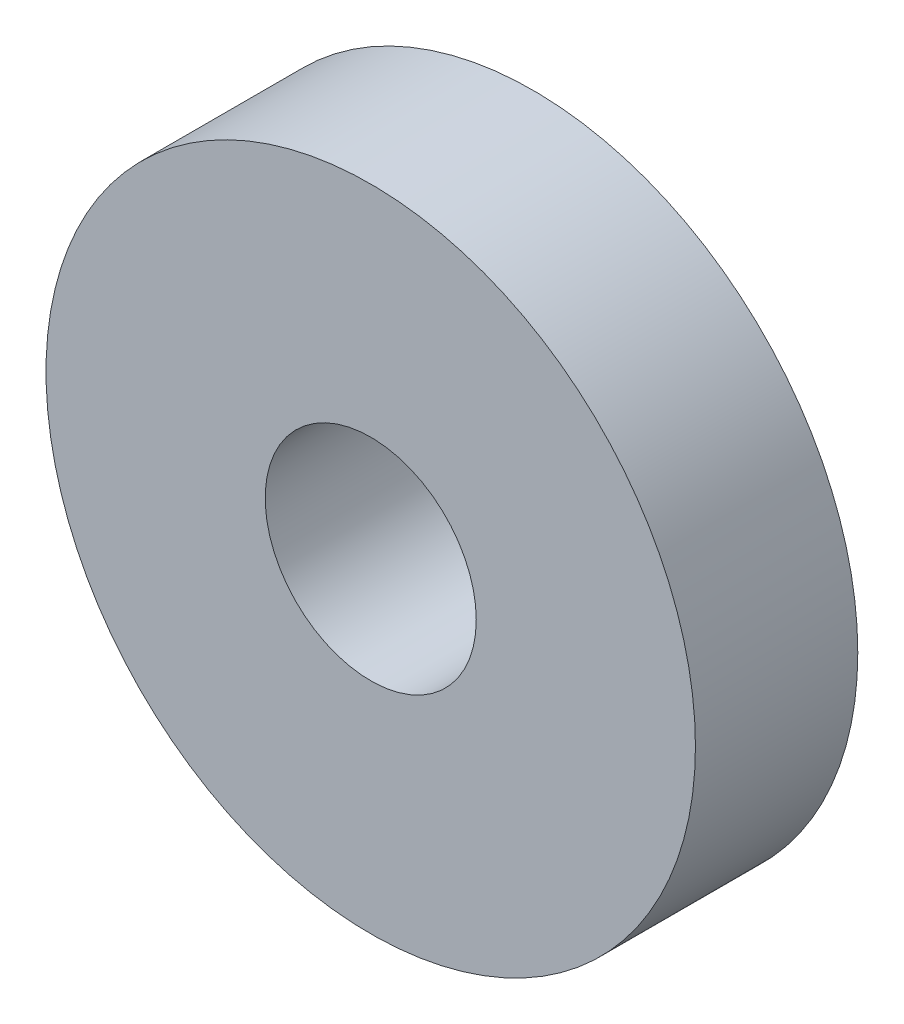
ISO-10303-21;
HEADER;
FILE_DESCRIPTION(('STEP AP214'),'2;1');
FILE_NAME('part.step','',(''),(''),'','','');
FILE_SCHEMA(('AUTOMOTIVE_DESIGN { 1 0 10303 214 1 1 1 1 }'));
ENDSEC;
DATA;
#1=APPLICATION_CONTEXT('core data for automotive mechanical design processes');
#2=APPLICATION_PROTOCOL_DEFINITION('international standard','automotive_design',2000,#1);
#3=PRODUCT_CONTEXT('',#1,'mechanical');
#4=PRODUCT('Part','Part','',(#3));
#5=PRODUCT_RELATED_PRODUCT_CATEGORY('part','',(#4));
#6=PRODUCT_DEFINITION_FORMATION('','',#4);
#7=PRODUCT_DEFINITION_CONTEXT('part definition',#1,'design');
#8=PRODUCT_DEFINITION('design','',#6,#7);
#9=PRODUCT_DEFINITION_SHAPE('','',#8);
#10=(LENGTH_UNIT() NAMED_UNIT(*) SI_UNIT(.MILLI.,.METRE.));
#11=(NAMED_UNIT(*) PLANE_ANGLE_UNIT() SI_UNIT($,.RADIAN.));
#12=(NAMED_UNIT(*) SI_UNIT($,.STERADIAN.) SOLID_ANGLE_UNIT());
#13=UNCERTAINTY_MEASURE_WITH_UNIT(LENGTH_MEASURE(1.E-05),#10,'distance_accuracy_value','');
#14=(GEOMETRIC_REPRESENTATION_CONTEXT(3) GLOBAL_UNCERTAINTY_ASSIGNED_CONTEXT((#13)) GLOBAL_UNIT_ASSIGNED_CONTEXT((#10,
#11,#12)) REPRESENTATION_CONTEXT('',''));
#15=CARTESIAN_POINT('',(0.,0.,0.));
#16=DIRECTION('',(0.,0.,1.));
#17=DIRECTION('',(1.,0.,0.));
#18=AXIS2_PLACEMENT_3D('',#15,#16,#17);
#19=CARTESIAN_POINT('',(0.,0.,10.));
#20=DIRECTION('',(0.,0.,1.));
#21=DIRECTION('',(1.,0.,0.));
#22=AXIS2_PLACEMENT_3D('',#19,#20,#21);
#23=PLANE('',#22);
#24=CARTESIAN_POINT('',(0.,0.,10.));
#25=DIRECTION('',(0.,0.,1.));
#26=DIRECTION('',(1.,0.,0.));
#27=AXIS2_PLACEMENT_3D('',#24,#25,#26);
#28=CIRCLE('',#27,20.);
#29=CARTESIAN_POINT('',(20.,0.,10.));
#30=VERTEX_POINT('',#29);
#31=EDGE_CURVE('E8',#30,#30,#28,.T.);
#32=ORIENTED_EDGE('',*,*,#31,.T.);
#33=EDGE_LOOP('',(#32));
#34=FACE_BOUND('',#33,.T.);
#35=CARTESIAN_POINT('',(0.,0.,10.));
#36=DIRECTION('',(0.,0.,1.));
#37=DIRECTION('',(1.,0.,0.));
#38=AXIS2_PLACEMENT_3D('',#35,#36,#37);
#39=CIRCLE('',#38,6.5);
#40=CARTESIAN_POINT('',(6.5,0.,10.));
#41=VERTEX_POINT('',#40);
#42=EDGE_CURVE('E23',#41,#41,#39,.T.);
#43=ORIENTED_EDGE('',*,*,#42,.F.);
#44=EDGE_LOOP('',(#43));
#45=FACE_BOUND('',#44,.T.);
#46=ADVANCED_FACE('F12',(#34,#45),#23,.T.);
#47=CARTESIAN_POINT('',(0.,0.,0.));
#48=DIRECTION('',(0.,0.,1.));
#49=DIRECTION('',(1.,0.,0.));
#50=AXIS2_PLACEMENT_3D('',#47,#48,#49);
#51=PLANE('',#50);
#52=CARTESIAN_POINT('',(0.,0.,0.));
#53=DIRECTION('',(0.,0.,1.));
#54=DIRECTION('',(1.,0.,0.));
#55=AXIS2_PLACEMENT_3D('',#52,#53,#54);
#56=CIRCLE('',#55,20.);
#57=CARTESIAN_POINT('',(20.,0.,0.));
#58=VERTEX_POINT('',#57);
#59=EDGE_CURVE('E19',#58,#58,#56,.T.);
#60=ORIENTED_EDGE('',*,*,#59,.F.);
#61=EDGE_LOOP('',(#60));
#62=FACE_BOUND('',#61,.T.);
#63=CARTESIAN_POINT('',(0.,0.,0.));
#64=DIRECTION('',(0.,0.,1.));
#65=DIRECTION('',(1.,0.,0.));
#66=AXIS2_PLACEMENT_3D('',#63,#64,#65);
#67=CIRCLE('',#66,6.5);
#68=CARTESIAN_POINT('',(6.5,0.,0.));
#69=VERTEX_POINT('',#68);
#70=EDGE_CURVE('E27',#69,#69,#67,.T.);
#71=ORIENTED_EDGE('',*,*,#70,.T.);
#72=EDGE_LOOP('',(#71));
#73=FACE_BOUND('',#72,.T.);
#74=ADVANCED_FACE('F33',(#62,#73),#51,.F.);
#75=CARTESIAN_POINT('',(0.,0.,10.));
#76=DIRECTION('',(0.,0.,-1.));
#77=DIRECTION('',(-1.,0.,0.));
#78=AXIS2_PLACEMENT_3D('',#75,#76,#77);
#79=CYLINDRICAL_SURFACE('',#78,20.);
#80=ORIENTED_EDGE('',*,*,#31,.F.);
#81=EDGE_LOOP('',(#80));
#82=FACE_BOUND('',#81,.T.);
#83=ORIENTED_EDGE('',*,*,#59,.T.);
#84=EDGE_LOOP('',(#83));
#85=FACE_BOUND('',#84,.T.);
#86=ADVANCED_FACE('F14',(#82,#85),#79,.T.);
#87=CARTESIAN_POINT('',(0.,0.,10.));
#88=DIRECTION('',(0.,0.,-1.));
#89=DIRECTION('',(-1.,0.,0.));
#90=AXIS2_PLACEMENT_3D('',#87,#88,#89);
#91=CYLINDRICAL_SURFACE('',#90,6.5);
#92=ORIENTED_EDGE('',*,*,#42,.T.);
#93=EDGE_LOOP('',(#92));
#94=FACE_BOUND('',#93,.T.);
#95=ORIENTED_EDGE('',*,*,#70,.F.);
#96=EDGE_LOOP('',(#95));
#97=FACE_BOUND('',#96,.T.);
#98=ADVANCED_FACE('F35',(#94,#97),#91,.F.);
#99=CLOSED_SHELL('',(#46,#74,#86,#98));
#100=MANIFOLD_SOLID_BREP('B1',#99);
#101=ADVANCED_BREP_SHAPE_REPRESENTATION('',(#18,#100),#14);
#102=SHAPE_DEFINITION_REPRESENTATION(#9,#101);
ENDSEC;
END-ISO-10303-21;
